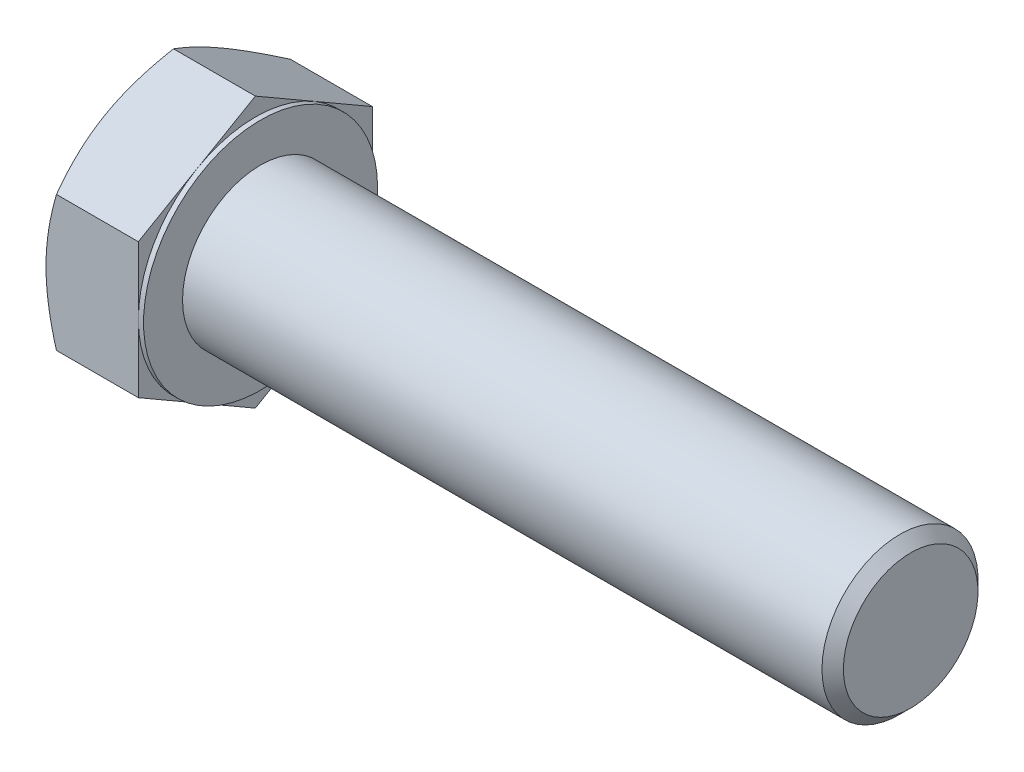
from build123d import *

# Parameters (mm, degrees)
BASEHEAD_DEPTH = 15
SKETCH4_W      = 0.8
SKETCH4_H      = 12.784609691


with BuildPart() as part:
    # Sketch1 → BaseHead (new body)
    with BuildSketch(Plane(origin=(0, 0, 0), x_dir=(0, 0, -1), z_dir=(1, 0, 0))):
        Polygon((18, 10.392304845), (18, -10.392304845), (0, -20.784609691), (-18, -10.392304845), (-18, 10.392304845), (0, 20.784609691), align=None)
    extrude(amount=BASEHEAD_DEPTH)

    # BodySke → BaseBody (revolve)
    with BuildSketch(Plane.XY, mode=Mode.PRIVATE) as basebody_sk:
        Polygon((0, 0), (115, 0), (115, 10.352), (113.352, 12), (0, 12), align=None)
    revolve(basebody_sk.sketch.rotate(Axis((0, 0, 0), (1, 0, 0)), 90), axis=Axis((0, 0, 0), (1, 0, 0)))

    # Sketch3 → HeadChamfer (revolve, cut)
    with BuildSketch(Plane.XY):
        Polygon((0, 18), (4.494446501, 25.784609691), (4.494446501, 30.784609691), (-10, 30.784609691), (-10, 18), align=None)
    revolve(axis=Axis((0, 0, 0), (1, 0, 0)), mode=Mode.SUBTRACT)

    # Sketch4 → BearingFace (revolve, cut)
    with BuildSketch(Plane.XY, mode=Mode.PRIVATE) as bearingface_sk:
        with Locations((14.6, 24.392304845)):
            Rectangle(SKETCH4_W, SKETCH4_H)
    revolve(bearingface_sk.sketch.rotate(Axis((0, 0, 0), (1, 0, 0)), 270), axis=Axis((0, 0, 0), (1, 0, 0)), mode=Mode.SUBTRACT)


solid = part.part
